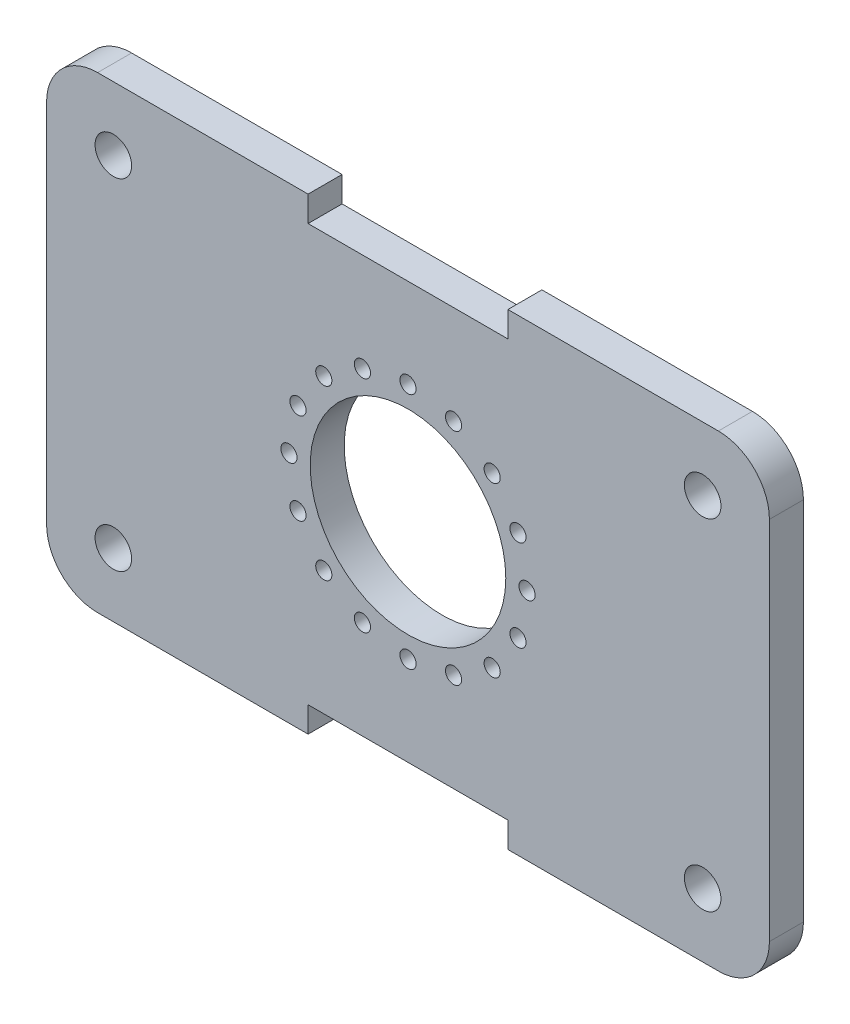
ISO-10303-21;
HEADER;
FILE_DESCRIPTION(('STEP AP214'),'2;1');
FILE_NAME('part.step','',(''),(''),'','','');
FILE_SCHEMA(('AUTOMOTIVE_DESIGN { 1 0 10303 214 1 1 1 1 }'));
ENDSEC;
DATA;
#1=APPLICATION_CONTEXT('core data for automotive mechanical design processes');
#2=APPLICATION_PROTOCOL_DEFINITION('international standard','automotive_design',2000,#1);
#3=PRODUCT_CONTEXT('',#1,'mechanical');
#4=PRODUCT('Part','Part','',(#3));
#5=PRODUCT_RELATED_PRODUCT_CATEGORY('part','',(#4));
#6=PRODUCT_DEFINITION_FORMATION('','',#4);
#7=PRODUCT_DEFINITION_CONTEXT('part definition',#1,'design');
#8=PRODUCT_DEFINITION('design','',#6,#7);
#9=PRODUCT_DEFINITION_SHAPE('','',#8);
#10=(LENGTH_UNIT() NAMED_UNIT(*) SI_UNIT(.MILLI.,.METRE.));
#11=(NAMED_UNIT(*) PLANE_ANGLE_UNIT() SI_UNIT($,.RADIAN.));
#12=(NAMED_UNIT(*) SI_UNIT($,.STERADIAN.) SOLID_ANGLE_UNIT());
#13=UNCERTAINTY_MEASURE_WITH_UNIT(LENGTH_MEASURE(1.E-05),#10,'distance_accuracy_value','');
#14=(GEOMETRIC_REPRESENTATION_CONTEXT(3) GLOBAL_UNCERTAINTY_ASSIGNED_CONTEXT((#13)) GLOBAL_UNIT_ASSIGNED_CONTEXT((#10,
#11,#12)) REPRESENTATION_CONTEXT('',''));
#15=CARTESIAN_POINT('',(0.,0.,0.));
#16=DIRECTION('',(0.,0.,1.));
#17=DIRECTION('',(1.,0.,0.));
#18=AXIS2_PLACEMENT_3D('',#15,#16,#17);
#19=CARTESIAN_POINT('',(-23.5000000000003,-103.999999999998,8.));
#20=DIRECTION('',(1.,0.,0.));
#21=DIRECTION('',(0.,1.,0.));
#22=AXIS2_PLACEMENT_3D('',#19,#20,#21);
#23=PLANE('',#22);
#24=DIRECTION('',(0.,0.,1.));
#25=VECTOR('',#24,1.);
#26=CARTESIAN_POINT('',(-23.5000000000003,-103.999999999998,8.));
#27=LINE('',#26,#25);
#28=CARTESIAN_POINT('',(-23.5000000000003,-103.999999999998,0.));
#29=VERTEX_POINT('',#28);
#30=CARTESIAN_POINT('',(-23.5000000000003,-103.999999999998,8.));
#31=VERTEX_POINT('',#30);
#32=EDGE_CURVE('E11',#29,#31,#27,.T.);
#33=ORIENTED_EDGE('',*,*,#32,.F.);
#34=DIRECTION('',(0.,1.,0.));
#35=VECTOR('',#34,1.);
#36=CARTESIAN_POINT('',(-23.5000000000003,-91.9999999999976,0.));
#37=LINE('',#36,#35);
#38=CARTESIAN_POINT('',(-23.5000000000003,-97.9999999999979,0.));
#39=VERTEX_POINT('',#38);
#40=EDGE_CURVE('E127',#29,#39,#37,.T.);
#41=ORIENTED_EDGE('',*,*,#40,.T.);
#42=DIRECTION('',(0.,0.,1.));
#43=VECTOR('',#42,1.);
#44=CARTESIAN_POINT('',(-23.5000000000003,-97.9999999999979,8.));
#45=LINE('',#44,#43);
#46=CARTESIAN_POINT('',(-23.5000000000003,-97.9999999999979,8.));
#47=VERTEX_POINT('',#46);
#48=EDGE_CURVE('E44',#39,#47,#45,.T.);
#49=ORIENTED_EDGE('',*,*,#48,.T.);
#50=DIRECTION('',(0.,1.,0.));
#51=VECTOR('',#50,1.);
#52=CARTESIAN_POINT('',(-23.5000000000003,-103.999999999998,8.));
#53=LINE('',#52,#51);
#54=EDGE_CURVE('E250',#31,#47,#53,.T.);
#55=ORIENTED_EDGE('',*,*,#54,.F.);
#56=EDGE_LOOP('',(#33,#41,#49,#55));
#57=FACE_BOUND('',#56,.T.);
#58=ADVANCED_FACE('F34',(#57),#23,.T.);
#59=CARTESIAN_POINT('',(-23.5000000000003,-97.9999999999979,8.));
#60=DIRECTION('',(0.,-1.,0.));
#61=DIRECTION('',(1.,0.,0.));
#62=AXIS2_PLACEMENT_3D('',#59,#60,#61);
#63=PLANE('',#62);
#64=ORIENTED_EDGE('',*,*,#48,.F.);
#65=DIRECTION('',(1.,0.,0.));
#66=VECTOR('',#65,1.);
#67=CARTESIAN_POINT('',(-73.0000000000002,-97.9999999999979,0.));
#68=LINE('',#67,#66);
#69=CARTESIAN_POINT('',(23.4999999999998,-97.9999999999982,0.));
#70=VERTEX_POINT('',#69);
#71=EDGE_CURVE('E173',#39,#70,#68,.T.);
#72=ORIENTED_EDGE('',*,*,#71,.T.);
#73=DIRECTION('',(0.,0.,1.));
#74=VECTOR('',#73,1.);
#75=CARTESIAN_POINT('',(23.4999999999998,-97.9999999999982,8.));
#76=LINE('',#75,#74);
#77=CARTESIAN_POINT('',(23.4999999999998,-97.9999999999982,8.));
#78=VERTEX_POINT('',#77);
#79=EDGE_CURVE('E243',#70,#78,#76,.T.);
#80=ORIENTED_EDGE('',*,*,#79,.T.);
#81=DIRECTION('',(1.,0.,0.));
#82=VECTOR('',#81,1.);
#83=CARTESIAN_POINT('',(-23.5000000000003,-97.9999999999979,8.));
#84=LINE('',#83,#82);
#85=EDGE_CURVE('E260',#47,#78,#84,.T.);
#86=ORIENTED_EDGE('',*,*,#85,.F.);
#87=EDGE_LOOP('',(#64,#72,#80,#86));
#88=FACE_BOUND('',#87,.T.);
#89=ADVANCED_FACE('F263',(#88),#63,.T.);
#90=CARTESIAN_POINT('',(23.4999999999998,-97.9999999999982,8.));
#91=DIRECTION('',(-1.,0.,0.));
#92=DIRECTION('',(0.,-1.,0.));
#93=AXIS2_PLACEMENT_3D('',#90,#91,#92);
#94=PLANE('',#93);
#95=ORIENTED_EDGE('',*,*,#79,.F.);
#96=DIRECTION('',(0.,1.,0.));
#97=VECTOR('',#96,1.);
#98=CARTESIAN_POINT('',(23.4999999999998,-91.9999999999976,0.));
#99=LINE('',#98,#97);
#100=CARTESIAN_POINT('',(23.4999999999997,-103.999999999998,0.));
#101=VERTEX_POINT('',#100);
#102=EDGE_CURVE('E170',#70,#101,#99,.F.);
#103=ORIENTED_EDGE('',*,*,#102,.T.);
#104=DIRECTION('',(0.,0.,1.));
#105=VECTOR('',#104,1.);
#106=CARTESIAN_POINT('',(23.4999999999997,-103.999999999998,8.));
#107=LINE('',#106,#105);
#108=CARTESIAN_POINT('',(23.4999999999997,-103.999999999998,8.));
#109=VERTEX_POINT('',#108);
#110=EDGE_CURVE('E240',#101,#109,#107,.T.);
#111=ORIENTED_EDGE('',*,*,#110,.T.);
#112=DIRECTION('',(0.,-1.,0.));
#113=VECTOR('',#112,1.);
#114=CARTESIAN_POINT('',(23.4999999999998,-97.9999999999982,8.));
#115=LINE('',#114,#113);
#116=EDGE_CURVE('E264',#78,#109,#115,.T.);
#117=ORIENTED_EDGE('',*,*,#116,.F.);
#118=EDGE_LOOP('',(#95,#103,#111,#117));
#119=FACE_BOUND('',#118,.T.);
#120=ADVANCED_FACE('F383',(#119),#94,.T.);
#121=CARTESIAN_POINT('',(72.9999999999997,-103.999999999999,8.));
#122=DIRECTION('',(0.,-1.,0.));
#123=DIRECTION('',(1.,0.,0.));
#124=AXIS2_PLACEMENT_3D('',#121,#122,#123);
#125=PLANE('',#124);
#126=ORIENTED_EDGE('',*,*,#110,.F.);
#127=DIRECTION('',(1.,0.,0.));
#128=VECTOR('',#127,1.);
#129=CARTESIAN_POINT('',(-73.0000000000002,-103.999999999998,0.));
#130=LINE('',#129,#128);
#131=CARTESIAN_POINT('',(72.9999999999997,-103.999999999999,0.));
#132=VERTEX_POINT('',#131);
#133=EDGE_CURVE('E167',#101,#132,#130,.T.);
#134=ORIENTED_EDGE('',*,*,#133,.T.);
#135=DIRECTION('',(0.,0.,1.));
#136=VECTOR('',#135,1.);
#137=CARTESIAN_POINT('',(72.9999999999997,-103.999999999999,8.));
#138=LINE('',#137,#136);
#139=CARTESIAN_POINT('',(72.9999999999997,-103.999999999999,8.));
#140=VERTEX_POINT('',#139);
#141=EDGE_CURVE('E237',#132,#140,#138,.T.);
#142=ORIENTED_EDGE('',*,*,#141,.T.);
#143=DIRECTION('',(1.,0.,0.));
#144=VECTOR('',#143,1.);
#145=CARTESIAN_POINT('',(72.9999999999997,-103.999999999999,8.));
#146=LINE('',#145,#144);
#147=EDGE_CURVE('E266',#109,#140,#146,.T.);
#148=ORIENTED_EDGE('',*,*,#147,.F.);
#149=EDGE_LOOP('',(#126,#134,#142,#148));
#150=FACE_BOUND('',#149,.T.);
#151=ADVANCED_FACE('F569',(#150),#125,.T.);
#152=CARTESIAN_POINT('',(72.9999999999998,-91.9999999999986,8.));
#153=DIRECTION('',(0.,0.,1.));
#154=DIRECTION('',(1.,0.,0.));
#155=AXIS2_PLACEMENT_3D('',#152,#153,#154);
#156=CYLINDRICAL_SURFACE('',#155,12.);
#157=ORIENTED_EDGE('',*,*,#141,.F.);
#158=CARTESIAN_POINT('',(72.9999999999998,-91.9999999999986,0.));
#159=DIRECTION('',(0.,0.,1.));
#160=DIRECTION('',(1.,0.,0.));
#161=AXIS2_PLACEMENT_3D('',#158,#159,#160);
#162=CIRCLE('',#161,12.);
#163=CARTESIAN_POINT('',(84.9999999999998,-91.9999999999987,0.));
#164=VERTEX_POINT('',#163);
#165=EDGE_CURVE('E164',#132,#164,#162,.T.);
#166=ORIENTED_EDGE('',*,*,#165,.T.);
#167=DIRECTION('',(0.,0.,1.));
#168=VECTOR('',#167,1.);
#169=CARTESIAN_POINT('',(84.9999999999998,-91.9999999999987,8.));
#170=LINE('',#169,#168);
#171=CARTESIAN_POINT('',(84.9999999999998,-91.9999999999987,8.));
#172=VERTEX_POINT('',#171);
#173=EDGE_CURVE('E234',#164,#172,#170,.T.);
#174=ORIENTED_EDGE('',*,*,#173,.T.);
#175=CARTESIAN_POINT('',(72.9999999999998,-91.9999999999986,8.));
#176=DIRECTION('',(0.,0.,1.));
#177=DIRECTION('',(1.,0.,0.));
#178=AXIS2_PLACEMENT_3D('',#175,#176,#177);
#179=CIRCLE('',#178,12.);
#180=EDGE_CURVE('E272',#140,#172,#179,.T.);
#181=ORIENTED_EDGE('',*,*,#180,.F.);
#182=EDGE_LOOP('',(#157,#166,#174,#181));
#183=FACE_BOUND('',#182,.T.);
#184=ADVANCED_FACE('F566',(#183),#156,.T.);
#185=CARTESIAN_POINT('',(85.,-5.99999999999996,8.));
#186=DIRECTION('',(1.,0.,0.));
#187=DIRECTION('',(0.,1.,0.));
#188=AXIS2_PLACEMENT_3D('',#185,#186,#187);
#189=PLANE('',#188);
#190=ORIENTED_EDGE('',*,*,#173,.F.);
#191=DIRECTION('',(0.,1.,0.));
#192=VECTOR('',#191,1.);
#193=CARTESIAN_POINT('',(84.9999999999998,-91.9999999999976,0.));
#194=LINE('',#193,#192);
#195=CARTESIAN_POINT('',(85.0000000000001,-5.99999999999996,0.));
#196=VERTEX_POINT('',#195);
#197=EDGE_CURVE('E161',#164,#196,#194,.T.);
#198=ORIENTED_EDGE('',*,*,#197,.T.);
#199=DIRECTION('',(0.,0.,1.));
#200=VECTOR('',#199,1.);
#201=CARTESIAN_POINT('',(85.,-5.99999999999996,8.));
#202=LINE('',#201,#200);
#203=CARTESIAN_POINT('',(85.,-5.99999999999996,8.));
#204=VERTEX_POINT('',#203);
#205=EDGE_CURVE('E231',#196,#204,#202,.T.);
#206=ORIENTED_EDGE('',*,*,#205,.T.);
#207=DIRECTION('',(0.,1.,0.));
#208=VECTOR('',#207,1.);
#209=CARTESIAN_POINT('',(85.,-5.99999999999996,8.));
#210=LINE('',#209,#208);
#211=EDGE_CURVE('E275',#172,#204,#210,.T.);
#212=ORIENTED_EDGE('',*,*,#211,.F.);
#213=EDGE_LOOP('',(#190,#198,#206,#212));
#214=FACE_BOUND('',#213,.T.);
#215=ADVANCED_FACE('F561',(#214),#189,.T.);
#216=CARTESIAN_POINT('',(73.,-6.,8.));
#217=DIRECTION('',(0.,0.,1.));
#218=DIRECTION('',(1.,0.,0.));
#219=AXIS2_PLACEMENT_3D('',#216,#217,#218);
#220=CYLINDRICAL_SURFACE('',#219,12.);
#221=ORIENTED_EDGE('',*,*,#205,.F.);
#222=CARTESIAN_POINT('',(73.,-6.,0.));
#223=DIRECTION('',(0.,0.,1.));
#224=DIRECTION('',(1.,0.,0.));
#225=AXIS2_PLACEMENT_3D('',#222,#223,#224);
#226=CIRCLE('',#225,12.);
#227=CARTESIAN_POINT('',(73.0000000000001,6.00000000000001,0.));
#228=VERTEX_POINT('',#227);
#229=EDGE_CURVE('E158',#196,#228,#226,.T.);
#230=ORIENTED_EDGE('',*,*,#229,.T.);
#231=DIRECTION('',(0.,0.,1.));
#232=VECTOR('',#231,1.);
#233=CARTESIAN_POINT('',(73.,6.00000000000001,8.));
#234=LINE('',#233,#232);
#235=CARTESIAN_POINT('',(73.,6.00000000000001,8.));
#236=VERTEX_POINT('',#235);
#237=EDGE_CURVE('E228',#228,#236,#234,.T.);
#238=ORIENTED_EDGE('',*,*,#237,.T.);
#239=CARTESIAN_POINT('',(73.,-6.,8.));
#240=DIRECTION('',(0.,0.,1.));
#241=DIRECTION('',(1.,0.,0.));
#242=AXIS2_PLACEMENT_3D('',#239,#240,#241);
#243=CIRCLE('',#242,12.);
#244=EDGE_CURVE('E278',#204,#236,#243,.T.);
#245=ORIENTED_EDGE('',*,*,#244,.F.);
#246=EDGE_LOOP('',(#221,#230,#238,#245));
#247=FACE_BOUND('',#246,.T.);
#248=ADVANCED_FACE('F557',(#247),#220,.T.);
#249=CARTESIAN_POINT('',(23.5,6.,8.));
#250=DIRECTION('',(0.,1.,0.));
#251=DIRECTION('',(-1.,0.,0.));
#252=AXIS2_PLACEMENT_3D('',#249,#250,#251);
#253=PLANE('',#252);
#254=ORIENTED_EDGE('',*,*,#237,.F.);
#255=DIRECTION('',(1.,0.,0.));
#256=VECTOR('',#255,1.);
#257=CARTESIAN_POINT('',(-73.0000000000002,6.00000000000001,0.));
#258=LINE('',#257,#256);
#259=CARTESIAN_POINT('',(23.5,6.00000000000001,0.));
#260=VERTEX_POINT('',#259);
#261=EDGE_CURVE('E155',#228,#260,#258,.F.);
#262=ORIENTED_EDGE('',*,*,#261,.T.);
#263=DIRECTION('',(0.,0.,1.));
#264=VECTOR('',#263,1.);
#265=CARTESIAN_POINT('',(23.5,6.,8.));
#266=LINE('',#265,#264);
#267=CARTESIAN_POINT('',(23.5,6.,8.));
#268=VERTEX_POINT('',#267);
#269=EDGE_CURVE('E225',#260,#268,#266,.T.);
#270=ORIENTED_EDGE('',*,*,#269,.T.);
#271=DIRECTION('',(-1.,0.,0.));
#272=VECTOR('',#271,1.);
#273=CARTESIAN_POINT('',(23.5,6.,8.));
#274=LINE('',#273,#272);
#275=EDGE_CURVE('E281',#236,#268,#274,.T.);
#276=ORIENTED_EDGE('',*,*,#275,.F.);
#277=EDGE_LOOP('',(#254,#262,#270,#276));
#278=FACE_BOUND('',#277,.T.);
#279=ADVANCED_FACE('F554',(#278),#253,.T.);
#280=CARTESIAN_POINT('',(23.5,0.,8.));
#281=DIRECTION('',(-1.,0.,0.));
#282=DIRECTION('',(0.,-1.,0.));
#283=AXIS2_PLACEMENT_3D('',#280,#281,#282);
#284=PLANE('',#283);
#285=ORIENTED_EDGE('',*,*,#269,.F.);
#286=DIRECTION('',(0.,1.,0.));
#287=VECTOR('',#286,1.);
#288=CARTESIAN_POINT('',(23.5,-91.9999999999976,0.));
#289=LINE('',#288,#287);
#290=CARTESIAN_POINT('',(23.5,0.,0.));
#291=VERTEX_POINT('',#290);
#292=EDGE_CURVE('E152',#260,#291,#289,.F.);
#293=ORIENTED_EDGE('',*,*,#292,.T.);
#294=DIRECTION('',(0.,0.,1.));
#295=VECTOR('',#294,1.);
#296=CARTESIAN_POINT('',(23.5,0.,8.));
#297=LINE('',#296,#295);
#298=CARTESIAN_POINT('',(23.5,0.,8.));
#299=VERTEX_POINT('',#298);
#300=EDGE_CURVE('E222',#291,#299,#297,.T.);
#301=ORIENTED_EDGE('',*,*,#300,.T.);
#302=DIRECTION('',(0.,-1.,0.));
#303=VECTOR('',#302,1.);
#304=CARTESIAN_POINT('',(23.5,0.,8.));
#305=LINE('',#304,#303);
#306=EDGE_CURVE('E284',#268,#299,#305,.T.);
#307=ORIENTED_EDGE('',*,*,#306,.F.);
#308=EDGE_LOOP('',(#285,#293,#301,#307));
#309=FACE_BOUND('',#308,.T.);
#310=ADVANCED_FACE('F549',(#309),#284,.T.);
#311=CARTESIAN_POINT('',(-23.5,0.,8.));
#312=DIRECTION('',(0.,1.,0.));
#313=DIRECTION('',(-1.,0.,0.));
#314=AXIS2_PLACEMENT_3D('',#311,#312,#313);
#315=PLANE('',#314);
#316=ORIENTED_EDGE('',*,*,#300,.F.);
#317=DIRECTION('',(1.,0.,0.));
#318=VECTOR('',#317,1.);
#319=CARTESIAN_POINT('',(-73.0000000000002,0.,0.));
#320=LINE('',#319,#318);
#321=CARTESIAN_POINT('',(-23.5,0.,0.));
#322=VERTEX_POINT('',#321);
#323=EDGE_CURVE('E149',#291,#322,#320,.F.);
#324=ORIENTED_EDGE('',*,*,#323,.T.);
#325=DIRECTION('',(0.,0.,1.));
#326=VECTOR('',#325,1.);
#327=CARTESIAN_POINT('',(-23.5,0.,8.));
#328=LINE('',#327,#326);
#329=CARTESIAN_POINT('',(-23.5,0.,8.));
#330=VERTEX_POINT('',#329);
#331=EDGE_CURVE('E219',#322,#330,#328,.T.);
#332=ORIENTED_EDGE('',*,*,#331,.T.);
#333=DIRECTION('',(-1.,0.,0.));
#334=VECTOR('',#333,1.);
#335=CARTESIAN_POINT('',(-23.5,0.,8.));
#336=LINE('',#335,#334);
#337=EDGE_CURVE('E287',#299,#330,#336,.T.);
#338=ORIENTED_EDGE('',*,*,#337,.F.);
#339=EDGE_LOOP('',(#316,#324,#332,#338));
#340=FACE_BOUND('',#339,.T.);
#341=ADVANCED_FACE('F545',(#340),#315,.T.);
#342=CARTESIAN_POINT('',(-23.5,6.,8.));
#343=DIRECTION('',(1.,0.,0.));
#344=DIRECTION('',(0.,1.,0.));
#345=AXIS2_PLACEMENT_3D('',#342,#343,#344);
#346=PLANE('',#345);
#347=ORIENTED_EDGE('',*,*,#331,.F.);
#348=DIRECTION('',(0.,1.,0.));
#349=VECTOR('',#348,1.);
#350=CARTESIAN_POINT('',(-23.5,-91.9999999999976,0.));
#351=LINE('',#350,#349);
#352=CARTESIAN_POINT('',(-23.5,6.00000000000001,0.));
#353=VERTEX_POINT('',#352);
#354=EDGE_CURVE('E146',#322,#353,#351,.T.);
#355=ORIENTED_EDGE('',*,*,#354,.T.);
#356=DIRECTION('',(0.,0.,1.));
#357=VECTOR('',#356,1.);
#358=CARTESIAN_POINT('',(-23.5,6.,8.));
#359=LINE('',#358,#357);
#360=CARTESIAN_POINT('',(-23.5,6.,8.));
#361=VERTEX_POINT('',#360);
#362=EDGE_CURVE('E216',#353,#361,#359,.T.);
#363=ORIENTED_EDGE('',*,*,#362,.T.);
#364=DIRECTION('',(0.,1.,0.));
#365=VECTOR('',#364,1.);
#366=CARTESIAN_POINT('',(-23.5,6.,8.));
#367=LINE('',#366,#365);
#368=EDGE_CURVE('E290',#330,#361,#367,.T.);
#369=ORIENTED_EDGE('',*,*,#368,.F.);
#370=EDGE_LOOP('',(#347,#355,#363,#369));
#371=FACE_BOUND('',#370,.T.);
#372=ADVANCED_FACE('F542',(#371),#346,.T.);
#373=CARTESIAN_POINT('',(-73.,6.,8.));
#374=DIRECTION('',(0.,1.,0.));
#375=DIRECTION('',(-1.,0.,0.));
#376=AXIS2_PLACEMENT_3D('',#373,#374,#375);
#377=PLANE('',#376);
#378=ORIENTED_EDGE('',*,*,#362,.F.);
#379=DIRECTION('',(1.,0.,0.));
#380=VECTOR('',#379,1.);
#381=CARTESIAN_POINT('',(-73.0000000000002,6.00000000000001,0.));
#382=LINE('',#381,#380);
#383=CARTESIAN_POINT('',(-73.,5.99999999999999,0.));
#384=VERTEX_POINT('',#383);
#385=EDGE_CURVE('E143',#353,#384,#382,.F.);
#386=ORIENTED_EDGE('',*,*,#385,.T.);
#387=DIRECTION('',(0.,0.,1.));
#388=VECTOR('',#387,1.);
#389=CARTESIAN_POINT('',(-73.,5.99999999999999,8.));
#390=LINE('',#389,#388);
#391=CARTESIAN_POINT('',(-73.,5.99999999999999,8.));
#392=VERTEX_POINT('',#391);
#393=EDGE_CURVE('E213',#384,#392,#390,.T.);
#394=ORIENTED_EDGE('',*,*,#393,.T.);
#395=DIRECTION('',(-1.,0.,0.));
#396=VECTOR('',#395,1.);
#397=CARTESIAN_POINT('',(-73.,6.,8.));
#398=LINE('',#397,#396);
#399=EDGE_CURVE('E293',#361,#392,#398,.T.);
#400=ORIENTED_EDGE('',*,*,#399,.F.);
#401=EDGE_LOOP('',(#378,#386,#394,#400));
#402=FACE_BOUND('',#401,.T.);
#403=ADVANCED_FACE('F532',(#402),#377,.T.);
#404=CARTESIAN_POINT('',(-73.,-5.99999999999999,8.));
#405=DIRECTION('',(0.,0.,1.));
#406=DIRECTION('',(1.,0.,0.));
#407=AXIS2_PLACEMENT_3D('',#404,#405,#406);
#408=CYLINDRICAL_SURFACE('',#407,12.);
#409=ORIENTED_EDGE('',*,*,#393,.F.);
#410=CARTESIAN_POINT('',(-73.,-5.99999999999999,0.));
#411=DIRECTION('',(0.,0.,1.));
#412=DIRECTION('',(1.,0.,0.));
#413=AXIS2_PLACEMENT_3D('',#410,#411,#412);
#414=CIRCLE('',#413,12.);
#415=CARTESIAN_POINT('',(-85.,-5.99999999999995,0.));
#416=VERTEX_POINT('',#415);
#417=EDGE_CURVE('E140',#384,#416,#414,.T.);
#418=ORIENTED_EDGE('',*,*,#417,.T.);
#419=DIRECTION('',(0.,0.,1.));
#420=VECTOR('',#419,1.);
#421=CARTESIAN_POINT('',(-85.,-5.99999999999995,8.));
#422=LINE('',#421,#420);
#423=CARTESIAN_POINT('',(-85.,-5.99999999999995,8.));
#424=VERTEX_POINT('',#423);
#425=EDGE_CURVE('E211',#416,#424,#422,.T.);
#426=ORIENTED_EDGE('',*,*,#425,.T.);
#427=CARTESIAN_POINT('',(-73.,-5.99999999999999,8.));
#428=DIRECTION('',(0.,0.,1.));
#429=DIRECTION('',(1.,0.,0.));
#430=AXIS2_PLACEMENT_3D('',#427,#428,#429);
#431=CIRCLE('',#430,12.);
#432=EDGE_CURVE('E296',#392,#424,#431,.T.);
#433=ORIENTED_EDGE('',*,*,#432,.F.);
#434=EDGE_LOOP('',(#409,#418,#426,#433));
#435=FACE_BOUND('',#434,.T.);
#436=ADVANCED_FACE('F538',(#435),#408,.T.);
#437=CARTESIAN_POINT('',(-85.0000000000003,-91.9999999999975,8.));
#438=DIRECTION('',(-1.,0.,0.));
#439=DIRECTION('',(0.,-1.,0.));
#440=AXIS2_PLACEMENT_3D('',#437,#438,#439);
#441=PLANE('',#440);
#442=ORIENTED_EDGE('',*,*,#425,.F.);
#443=DIRECTION('',(0.,1.,0.));
#444=VECTOR('',#443,1.);
#445=CARTESIAN_POINT('',(-85.,-91.9999999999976,0.));
#446=LINE('',#445,#444);
#447=CARTESIAN_POINT('',(-85.0000000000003,-91.9999999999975,0.));
#448=VERTEX_POINT('',#447);
#449=EDGE_CURVE('E137',#416,#448,#446,.F.);
#450=ORIENTED_EDGE('',*,*,#449,.T.);
#451=DIRECTION('',(0.,0.,1.));
#452=VECTOR('',#451,1.);
#453=CARTESIAN_POINT('',(-85.0000000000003,-91.9999999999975,8.));
#454=LINE('',#453,#452);
#455=CARTESIAN_POINT('',(-85.0000000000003,-91.9999999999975,8.));
#456=VERTEX_POINT('',#455);
#457=EDGE_CURVE('E52',#448,#456,#454,.T.);
#458=ORIENTED_EDGE('',*,*,#457,.T.);
#459=DIRECTION('',(0.,-1.,0.));
#460=VECTOR('',#459,1.);
#461=CARTESIAN_POINT('',(-85.0000000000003,-91.9999999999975,8.));
#462=LINE('',#461,#460);
#463=EDGE_CURVE('E299',#424,#456,#462,.T.);
#464=ORIENTED_EDGE('',*,*,#463,.F.);
#465=EDGE_LOOP('',(#442,#450,#458,#464));
#466=FACE_BOUND('',#465,.T.);
#467=ADVANCED_FACE('F459',(#466),#441,.T.);
#468=CARTESIAN_POINT('',(-73.0000000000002,-91.9999999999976,8.));
#469=DIRECTION('',(0.,0.,1.));
#470=DIRECTION('',(1.,0.,0.));
#471=AXIS2_PLACEMENT_3D('',#468,#469,#470);
#472=CYLINDRICAL_SURFACE('',#471,12.);
#473=ORIENTED_EDGE('',*,*,#457,.F.);
#474=CARTESIAN_POINT('',(-73.0000000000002,-91.9999999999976,0.));
#475=DIRECTION('',(0.,0.,1.));
#476=DIRECTION('',(1.,0.,0.));
#477=AXIS2_PLACEMENT_3D('',#474,#475,#476);
#478=CIRCLE('',#477,12.);
#479=CARTESIAN_POINT('',(-73.0000000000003,-103.999999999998,0.));
#480=VERTEX_POINT('',#479);
#481=EDGE_CURVE('E125',#448,#480,#478,.T.);
#482=ORIENTED_EDGE('',*,*,#481,.T.);
#483=DIRECTION('',(0.,0.,1.));
#484=VECTOR('',#483,1.);
#485=CARTESIAN_POINT('',(-73.0000000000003,-103.999999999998,8.));
#486=LINE('',#485,#484);
#487=CARTESIAN_POINT('',(-73.0000000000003,-103.999999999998,8.));
#488=VERTEX_POINT('',#487);
#489=EDGE_CURVE('E38',#480,#488,#486,.T.);
#490=ORIENTED_EDGE('',*,*,#489,.T.);
#491=CARTESIAN_POINT('',(-73.0000000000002,-91.9999999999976,8.));
#492=DIRECTION('',(0.,0.,1.));
#493=DIRECTION('',(1.,0.,0.));
#494=AXIS2_PLACEMENT_3D('',#491,#492,#493);
#495=CIRCLE('',#494,12.);
#496=EDGE_CURVE('E508',#456,#488,#495,.T.);
#497=ORIENTED_EDGE('',*,*,#496,.F.);
#498=EDGE_LOOP('',(#473,#482,#490,#497));
#499=FACE_BOUND('',#498,.T.);
#500=ADVANCED_FACE('F129',(#499),#472,.T.);
#501=CARTESIAN_POINT('',(19.7989898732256,-68.7989898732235,8.));
#502=DIRECTION('',(0.,0.,1.));
#503=DIRECTION('',(1.,0.,0.));
#504=AXIS2_PLACEMENT_3D('',#501,#502,#503);
#505=CYLINDRICAL_SURFACE('',#504,1.89999999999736);
#506=CARTESIAN_POINT('',(19.7989898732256,-68.7989898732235,8.));
#507=DIRECTION('',(0.,0.,1.));
#508=DIRECTION('',(1.,0.,0.));
#509=AXIS2_PLACEMENT_3D('',#506,#507,#508);
#510=CIRCLE('',#509,1.89999999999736);
#511=CARTESIAN_POINT('',(21.6989898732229,-68.7989898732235,8.));
#512=VERTEX_POINT('',#511);
#513=EDGE_CURVE('E209',#512,#512,#510,.T.);
#514=ORIENTED_EDGE('',*,*,#513,.T.);
#515=EDGE_LOOP('',(#514));
#516=FACE_BOUND('',#515,.T.);
#517=CARTESIAN_POINT('',(19.7989898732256,-68.7989898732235,0.));
#518=DIRECTION('',(0.,0.,1.));
#519=DIRECTION('',(1.,0.,0.));
#520=AXIS2_PLACEMENT_3D('',#517,#518,#519);
#521=CIRCLE('',#520,1.89999999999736);
#522=CARTESIAN_POINT('',(21.6989898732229,-68.7989898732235,0.));
#523=VERTEX_POINT('',#522);
#524=EDGE_CURVE('E334',#523,#523,#521,.T.);
#525=ORIENTED_EDGE('',*,*,#524,.F.);
#526=EDGE_LOOP('',(#525));
#527=FACE_BOUND('',#526,.T.);
#528=ADVANCED_FACE('F439',(#516,#527),#505,.F.);
#529=CARTESIAN_POINT('',(28.0000000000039,-48.9999999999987,8.));
#530=DIRECTION('',(0.,0.,1.));
#531=DIRECTION('',(1.,0.,0.));
#532=AXIS2_PLACEMENT_3D('',#529,#530,#531);
#533=CYLINDRICAL_SURFACE('',#532,1.89999999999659);
#534=CARTESIAN_POINT('',(28.0000000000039,-48.9999999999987,8.));
#535=DIRECTION('',(0.,0.,1.));
#536=DIRECTION('',(1.,0.,0.));
#537=AXIS2_PLACEMENT_3D('',#534,#535,#536);
#538=CIRCLE('',#537,1.89999999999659);
#539=CARTESIAN_POINT('',(29.9000000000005,-48.9999999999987,8.));
#540=VERTEX_POINT('',#539);
#541=EDGE_CURVE('E909',#540,#540,#538,.T.);
#542=ORIENTED_EDGE('',*,*,#541,.T.);
#543=EDGE_LOOP('',(#542));
#544=FACE_BOUND('',#543,.T.);
#545=CARTESIAN_POINT('',(28.0000000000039,-48.9999999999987,0.));
#546=DIRECTION('',(0.,0.,1.));
#547=DIRECTION('',(1.,0.,0.));
#548=AXIS2_PLACEMENT_3D('',#545,#546,#547);
#549=CIRCLE('',#548,1.89999999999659);
#550=CARTESIAN_POINT('',(29.9000000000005,-48.9999999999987,0.));
#551=VERTEX_POINT('',#550);
#552=EDGE_CURVE('E337',#551,#551,#549,.T.);
#553=ORIENTED_EDGE('',*,*,#552,.F.);
#554=EDGE_LOOP('',(#553));
#555=FACE_BOUND('',#554,.T.);
#556=ADVANCED_FACE('F450',(#544,#555),#533,.F.);
#557=CARTESIAN_POINT('',(19.7989898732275,-29.2010101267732,8.));
#558=DIRECTION('',(0.,0.,1.));
#559=DIRECTION('',(1.,0.,0.));
#560=AXIS2_PLACEMENT_3D('',#557,#558,#559);
#561=CYLINDRICAL_SURFACE('',#560,1.89999999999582);
#562=CARTESIAN_POINT('',(19.7989898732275,-29.2010101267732,8.));
#563=DIRECTION('',(0.,0.,1.));
#564=DIRECTION('',(1.,0.,0.));
#565=AXIS2_PLACEMENT_3D('',#562,#563,#564);
#566=CIRCLE('',#565,1.89999999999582);
#567=CARTESIAN_POINT('',(21.6989898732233,-29.2010101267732,8.));
#568=VERTEX_POINT('',#567);
#569=EDGE_CURVE('E906',#568,#568,#566,.T.);
#570=ORIENTED_EDGE('',*,*,#569,.T.);
#571=EDGE_LOOP('',(#570));
#572=FACE_BOUND('',#571,.T.);
#573=CARTESIAN_POINT('',(19.7989898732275,-29.2010101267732,0.));
#574=DIRECTION('',(0.,0.,1.));
#575=DIRECTION('',(1.,0.,0.));
#576=AXIS2_PLACEMENT_3D('',#573,#574,#575);
#577=CIRCLE('',#576,1.89999999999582);
#578=CARTESIAN_POINT('',(21.6989898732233,-29.2010101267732,0.));
#579=VERTEX_POINT('',#578);
#580=EDGE_CURVE('E340',#579,#579,#577,.T.);
#581=ORIENTED_EDGE('',*,*,#580,.F.);
#582=EDGE_LOOP('',(#581));
#583=FACE_BOUND('',#582,.T.);
#584=ADVANCED_FACE('F456',(#572,#583),#561,.F.);
#585=CARTESIAN_POINT('',(2.67275090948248E-12,-20.9999999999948,8.));
#586=DIRECTION('',(0.,0.,1.));
#587=DIRECTION('',(1.,0.,0.));
#588=AXIS2_PLACEMENT_3D('',#585,#586,#587);
#589=CYLINDRICAL_SURFACE('',#588,1.89999999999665);
#590=CARTESIAN_POINT('',(2.67275090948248E-12,-20.9999999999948,8.));
#591=DIRECTION('',(0.,0.,1.));
#592=DIRECTION('',(1.,0.,0.));
#593=AXIS2_PLACEMENT_3D('',#590,#591,#592);
#594=CIRCLE('',#593,1.89999999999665);
#595=CARTESIAN_POINT('',(1.89999999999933,-20.9999999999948,8.));
#596=VERTEX_POINT('',#595);
#597=EDGE_CURVE('E903',#596,#596,#594,.T.);
#598=ORIENTED_EDGE('',*,*,#597,.T.);
#599=EDGE_LOOP('',(#598));
#600=FACE_BOUND('',#599,.T.);
#601=CARTESIAN_POINT('',(2.67275090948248E-12,-20.9999999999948,0.));
#602=DIRECTION('',(0.,0.,1.));
#603=DIRECTION('',(1.,0.,0.));
#604=AXIS2_PLACEMENT_3D('',#601,#602,#603);
#605=CIRCLE('',#604,1.89999999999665);
#606=CARTESIAN_POINT('',(1.89999999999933,-20.9999999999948,0.));
#607=VERTEX_POINT('',#606);
#608=EDGE_CURVE('E343',#607,#607,#605,.T.);
#609=ORIENTED_EDGE('',*,*,#608,.F.);
#610=EDGE_LOOP('',(#609));
#611=FACE_BOUND('',#610,.T.);
#612=ADVANCED_FACE('F466',(#600,#611),#589,.F.);
#613=CARTESIAN_POINT('',(-19.7989898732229,-29.2010101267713,8.));
#614=DIRECTION('',(0.,0.,1.));
#615=DIRECTION('',(1.,0.,0.));
#616=AXIS2_PLACEMENT_3D('',#613,#614,#615);
#617=CYLINDRICAL_SURFACE('',#616,1.89999999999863);
#618=CARTESIAN_POINT('',(-19.7989898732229,-29.2010101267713,8.));
#619=DIRECTION('',(0.,0.,1.));
#620=DIRECTION('',(1.,0.,0.));
#621=AXIS2_PLACEMENT_3D('',#618,#619,#620);
#622=CIRCLE('',#621,1.89999999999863);
#623=CARTESIAN_POINT('',(-17.8989898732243,-29.2010101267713,8.));
#624=VERTEX_POINT('',#623);
#625=EDGE_CURVE('E500',#624,#624,#622,.T.);
#626=ORIENTED_EDGE('',*,*,#625,.T.);
#627=EDGE_LOOP('',(#626));
#628=FACE_BOUND('',#627,.T.);
#629=CARTESIAN_POINT('',(-19.7989898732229,-29.2010101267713,0.));
#630=DIRECTION('',(0.,0.,1.));
#631=DIRECTION('',(1.,0.,0.));
#632=AXIS2_PLACEMENT_3D('',#629,#630,#631);
#633=CIRCLE('',#632,1.89999999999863);
#634=CARTESIAN_POINT('',(-17.8989898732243,-29.2010101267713,0.));
#635=VERTEX_POINT('',#634);
#636=EDGE_CURVE('E346',#635,#635,#633,.T.);
#637=ORIENTED_EDGE('',*,*,#636,.F.);
#638=EDGE_LOOP('',(#637));
#639=FACE_BOUND('',#638,.T.);
#640=ADVANCED_FACE('F470',(#628,#639),#617,.F.);
#641=CARTESIAN_POINT('',(-28.0000000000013,-48.9999999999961,8.));
#642=DIRECTION('',(0.,0.,1.));
#643=DIRECTION('',(1.,0.,0.));
#644=AXIS2_PLACEMENT_3D('',#641,#642,#643);
#645=CYLINDRICAL_SURFACE('',#644,1.90000000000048);
#646=CARTESIAN_POINT('',(-28.0000000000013,-48.9999999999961,8.));
#647=DIRECTION('',(0.,0.,1.));
#648=DIRECTION('',(1.,0.,0.));
#649=AXIS2_PLACEMENT_3D('',#646,#647,#648);
#650=CIRCLE('',#649,1.90000000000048);
#651=CARTESIAN_POINT('',(-26.1000000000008,-48.9999999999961,8.));
#652=VERTEX_POINT('',#651);
#653=EDGE_CURVE('E494',#652,#652,#650,.T.);
#654=ORIENTED_EDGE('',*,*,#653,.T.);
#655=EDGE_LOOP('',(#654));
#656=FACE_BOUND('',#655,.T.);
#657=CARTESIAN_POINT('',(-28.0000000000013,-48.9999999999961,0.));
#658=DIRECTION('',(0.,0.,1.));
#659=DIRECTION('',(1.,0.,0.));
#660=AXIS2_PLACEMENT_3D('',#657,#658,#659);
#661=CIRCLE('',#660,1.90000000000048);
#662=CARTESIAN_POINT('',(-26.1000000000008,-48.9999999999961,0.));
#663=VERTEX_POINT('',#662);
#664=EDGE_CURVE('E349',#663,#663,#661,.T.);
#665=ORIENTED_EDGE('',*,*,#664,.F.);
#666=EDGE_LOOP('',(#665));
#667=FACE_BOUND('',#666,.T.);
#668=ADVANCED_FACE('F474',(#656,#667),#645,.F.);
#669=CARTESIAN_POINT('',(-19.7989898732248,-68.7989898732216,8.));
#670=DIRECTION('',(0.,0.,1.));
#671=DIRECTION('',(1.,0.,0.));
#672=AXIS2_PLACEMENT_3D('',#669,#670,#671);
#673=CYLINDRICAL_SURFACE('',#672,1.90000000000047);
#674=CARTESIAN_POINT('',(-19.7989898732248,-68.7989898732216,8.));
#675=DIRECTION('',(0.,0.,1.));
#676=DIRECTION('',(1.,0.,0.));
#677=AXIS2_PLACEMENT_3D('',#674,#675,#676);
#678=CIRCLE('',#677,1.90000000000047);
#679=CARTESIAN_POINT('',(-17.8989898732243,-68.7989898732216,8.));
#680=VERTEX_POINT('',#679);
#681=EDGE_CURVE('E486',#680,#680,#678,.T.);
#682=ORIENTED_EDGE('',*,*,#681,.T.);
#683=EDGE_LOOP('',(#682));
#684=FACE_BOUND('',#683,.T.);
#685=CARTESIAN_POINT('',(-19.7989898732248,-68.7989898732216,0.));
#686=DIRECTION('',(0.,0.,1.));
#687=DIRECTION('',(1.,0.,0.));
#688=AXIS2_PLACEMENT_3D('',#685,#686,#687);
#689=CIRCLE('',#688,1.90000000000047);
#690=CARTESIAN_POINT('',(-17.8989898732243,-68.7989898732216,0.));
#691=VERTEX_POINT('',#690);
#692=EDGE_CURVE('E352',#691,#691,#689,.T.);
#693=ORIENTED_EDGE('',*,*,#692,.F.);
#694=EDGE_LOOP('',(#693));
#695=FACE_BOUND('',#694,.T.);
#696=ADVANCED_FACE('F374',(#684,#695),#673,.F.);
#697=CARTESIAN_POINT('',(-69.3,-89.,8.));
#698=DIRECTION('',(0.,0.,1.));
#699=DIRECTION('',(1.,0.,0.));
#700=AXIS2_PLACEMENT_3D('',#697,#698,#699);
#701=CYLINDRICAL_SURFACE('',#700,4.3);
#702=CARTESIAN_POINT('',(-69.3,-89.,8.));
#703=DIRECTION('',(0.,0.,1.));
#704=DIRECTION('',(1.,0.,0.));
#705=AXIS2_PLACEMENT_3D('',#702,#703,#704);
#706=CIRCLE('',#705,4.3);
#707=CARTESIAN_POINT('',(-65.,-89.,8.));
#708=VERTEX_POINT('',#707);
#709=EDGE_CURVE('E493',#708,#708,#706,.T.);
#710=ORIENTED_EDGE('',*,*,#709,.T.);
#711=EDGE_LOOP('',(#710));
#712=FACE_BOUND('',#711,.T.);
#713=CARTESIAN_POINT('',(-69.3,-89.,0.));
#714=DIRECTION('',(0.,0.,1.));
#715=DIRECTION('',(1.,0.,0.));
#716=AXIS2_PLACEMENT_3D('',#713,#714,#715);
#717=CIRCLE('',#716,4.3);
#718=CARTESIAN_POINT('',(-65.,-89.,0.));
#719=VERTEX_POINT('',#718);
#720=EDGE_CURVE('E355',#719,#719,#717,.T.);
#721=ORIENTED_EDGE('',*,*,#720,.F.);
#722=EDGE_LOOP('',(#721));
#723=FACE_BOUND('',#722,.T.);
#724=ADVANCED_FACE('F365',(#712,#723),#701,.F.);
#725=CARTESIAN_POINT('',(69.3,-9.00000000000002,8.));
#726=DIRECTION('',(0.,0.,1.));
#727=DIRECTION('',(1.,0.,0.));
#728=AXIS2_PLACEMENT_3D('',#725,#726,#727);
#729=CYLINDRICAL_SURFACE('',#728,4.3);
#730=CARTESIAN_POINT('',(69.3,-9.00000000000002,8.));
#731=DIRECTION('',(0.,0.,1.));
#732=DIRECTION('',(1.,0.,0.));
#733=AXIS2_PLACEMENT_3D('',#730,#731,#732);
#734=CIRCLE('',#733,4.3);
#735=CARTESIAN_POINT('',(73.6,-9.00000000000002,8.));
#736=VERTEX_POINT('',#735);
#737=EDGE_CURVE('E497',#736,#736,#734,.T.);
#738=ORIENTED_EDGE('',*,*,#737,.T.);
#739=EDGE_LOOP('',(#738));
#740=FACE_BOUND('',#739,.T.);
#741=CARTESIAN_POINT('',(69.3,-9.00000000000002,0.));
#742=DIRECTION('',(0.,0.,1.));
#743=DIRECTION('',(1.,0.,0.));
#744=AXIS2_PLACEMENT_3D('',#741,#742,#743);
#745=CIRCLE('',#744,4.3);
#746=CARTESIAN_POINT('',(73.6,-9.00000000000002,0.));
#747=VERTEX_POINT('',#746);
#748=EDGE_CURVE('E133',#747,#747,#745,.T.);
#749=ORIENTED_EDGE('',*,*,#748,.F.);
#750=EDGE_LOOP('',(#749));
#751=FACE_BOUND('',#750,.T.);
#752=ADVANCED_FACE('F362',(#740,#751),#729,.F.);
#753=CARTESIAN_POINT('',(-3.05311331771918E-13,-77.,8.));
#754=DIRECTION('',(0.,0.,1.));
#755=DIRECTION('',(1.,0.,0.));
#756=AXIS2_PLACEMENT_3D('',#753,#754,#755);
#757=CYLINDRICAL_SURFACE('',#756,1.9);
#758=CARTESIAN_POINT('',(-3.05311331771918E-13,-77.,8.));
#759=DIRECTION('',(0.,0.,1.));
#760=DIRECTION('',(1.,0.,0.));
#761=AXIS2_PLACEMENT_3D('',#758,#759,#760);
#762=CIRCLE('',#761,1.9);
#763=CARTESIAN_POINT('',(1.89999999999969,-77.,8.));
#764=VERTEX_POINT('',#763);
#765=EDGE_CURVE('E505',#764,#764,#762,.T.);
#766=ORIENTED_EDGE('',*,*,#765,.T.);
#767=EDGE_LOOP('',(#766));
#768=FACE_BOUND('',#767,.T.);
#769=CARTESIAN_POINT('',(-3.05311331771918E-13,-77.,0.));
#770=DIRECTION('',(0.,0.,1.));
#771=DIRECTION('',(1.,0.,0.));
#772=AXIS2_PLACEMENT_3D('',#769,#770,#771);
#773=CIRCLE('',#772,1.9);
#774=CARTESIAN_POINT('',(1.89999999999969,-77.,0.));
#775=VERTEX_POINT('',#774);
#776=EDGE_CURVE('E130',#775,#775,#773,.T.);
#777=ORIENTED_EDGE('',*,*,#776,.F.);
#778=EDGE_LOOP('',(#777));
#779=FACE_BOUND('',#778,.T.);
#780=ADVANCED_FACE('F364',(#768,#779),#757,.F.);
#781=CARTESIAN_POINT('',(-23.5000000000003,-103.999999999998,8.));
#782=DIRECTION('',(0.,-1.,0.));
#783=DIRECTION('',(1.,0.,0.));
#784=AXIS2_PLACEMENT_3D('',#781,#782,#783);
#785=PLANE('',#784);
#786=DIRECTION('',(1.,0.,0.));
#787=VECTOR('',#786,1.);
#788=CARTESIAN_POINT('',(-73.0000000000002,-103.999999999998,0.));
#789=LINE('',#788,#787);
#790=EDGE_CURVE('E113',#480,#29,#789,.T.);
#791=ORIENTED_EDGE('',*,*,#790,.T.);
#792=ORIENTED_EDGE('',*,*,#32,.T.);
#793=DIRECTION('',(1.,0.,0.));
#794=VECTOR('',#793,1.);
#795=CARTESIAN_POINT('',(-23.5000000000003,-103.999999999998,8.));
#796=LINE('',#795,#794);
#797=EDGE_CURVE('E115',#488,#31,#796,.T.);
#798=ORIENTED_EDGE('',*,*,#797,.F.);
#799=ORIENTED_EDGE('',*,*,#489,.F.);
#800=EDGE_LOOP('',(#791,#792,#798,#799));
#801=FACE_BOUND('',#800,.T.);
#802=ADVANCED_FACE('F112',(#801),#785,.T.);
#803=CARTESIAN_POINT('',(0.,-49.,8.));
#804=DIRECTION('',(0.,0.,1.));
#805=DIRECTION('',(1.,0.,0.));
#806=AXIS2_PLACEMENT_3D('',#803,#804,#805);
#807=CYLINDRICAL_SURFACE('',#806,23.);
#808=CARTESIAN_POINT('',(0.,-49.,8.));
#809=DIRECTION('',(0.,0.,1.));
#810=DIRECTION('',(1.,0.,0.));
#811=AXIS2_PLACEMENT_3D('',#808,#809,#810);
#812=CIRCLE('',#811,23.);
#813=CARTESIAN_POINT('',(23.,-49.,8.));
#814=VERTEX_POINT('',#813);
#815=EDGE_CURVE('E302',#814,#814,#812,.T.);
#816=ORIENTED_EDGE('',*,*,#815,.T.);
#817=EDGE_LOOP('',(#816));
#818=FACE_BOUND('',#817,.T.);
#819=CARTESIAN_POINT('',(0.,-49.,0.));
#820=DIRECTION('',(0.,0.,1.));
#821=DIRECTION('',(1.,0.,0.));
#822=AXIS2_PLACEMENT_3D('',#819,#820,#821);
#823=CIRCLE('',#822,23.);
#824=CARTESIAN_POINT('',(23.,-49.,0.));
#825=VERTEX_POINT('',#824);
#826=EDGE_CURVE('E139',#825,#825,#823,.T.);
#827=ORIENTED_EDGE('',*,*,#826,.F.);
#828=EDGE_LOOP('',(#827));
#829=FACE_BOUND('',#828,.T.);
#830=ADVANCED_FACE('F389',(#818,#829),#807,.F.);
#831=CARTESIAN_POINT('',(-69.3,-9.00000000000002,8.));
#832=DIRECTION('',(0.,0.,1.));
#833=DIRECTION('',(1.,0.,0.));
#834=AXIS2_PLACEMENT_3D('',#831,#832,#833);
#835=CYLINDRICAL_SURFACE('',#834,4.3);
#836=CARTESIAN_POINT('',(-69.3,-9.00000000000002,8.));
#837=DIRECTION('',(0.,0.,1.));
#838=DIRECTION('',(1.,0.,0.));
#839=AXIS2_PLACEMENT_3D('',#836,#837,#838);
#840=CIRCLE('',#839,4.3);
#841=CARTESIAN_POINT('',(-65.,-9.00000000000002,8.));
#842=VERTEX_POINT('',#841);
#843=EDGE_CURVE('E305',#842,#842,#840,.T.);
#844=ORIENTED_EDGE('',*,*,#843,.T.);
#845=EDGE_LOOP('',(#844));
#846=FACE_BOUND('',#845,.T.);
#847=CARTESIAN_POINT('',(-69.3,-9.00000000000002,0.));
#848=DIRECTION('',(0.,0.,1.));
#849=DIRECTION('',(1.,0.,0.));
#850=AXIS2_PLACEMENT_3D('',#847,#848,#849);
#851=CIRCLE('',#850,4.3);
#852=CARTESIAN_POINT('',(-65.,-9.00000000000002,0.));
#853=VERTEX_POINT('',#852);
#854=EDGE_CURVE('E179',#853,#853,#851,.T.);
#855=ORIENTED_EDGE('',*,*,#854,.F.);
#856=EDGE_LOOP('',(#855));
#857=FACE_BOUND('',#856,.T.);
#858=ADVANCED_FACE('F392',(#846,#857),#835,.F.);
#859=CARTESIAN_POINT('',(69.3,-89.,8.));
#860=DIRECTION('',(0.,0.,1.));
#861=DIRECTION('',(1.,0.,0.));
#862=AXIS2_PLACEMENT_3D('',#859,#860,#861);
#863=CYLINDRICAL_SURFACE('',#862,4.3);
#864=CARTESIAN_POINT('',(69.3,-89.,8.));
#865=DIRECTION('',(0.,0.,1.));
#866=DIRECTION('',(1.,0.,0.));
#867=AXIS2_PLACEMENT_3D('',#864,#865,#866);
#868=CIRCLE('',#867,4.3);
#869=CARTESIAN_POINT('',(73.6,-89.,8.));
#870=VERTEX_POINT('',#869);
#871=EDGE_CURVE('E308',#870,#870,#868,.T.);
#872=ORIENTED_EDGE('',*,*,#871,.T.);
#873=EDGE_LOOP('',(#872));
#874=FACE_BOUND('',#873,.T.);
#875=CARTESIAN_POINT('',(69.3,-89.,0.));
#876=DIRECTION('',(0.,0.,1.));
#877=DIRECTION('',(1.,0.,0.));
#878=AXIS2_PLACEMENT_3D('',#875,#876,#877);
#879=CIRCLE('',#878,4.3);
#880=CARTESIAN_POINT('',(73.6,-89.,0.));
#881=VERTEX_POINT('',#880);
#882=EDGE_CURVE('E182',#881,#881,#879,.T.);
#883=ORIENTED_EDGE('',*,*,#882,.F.);
#884=EDGE_LOOP('',(#883));
#885=FACE_BOUND('',#884,.T.);
#886=ADVANCED_FACE('F396',(#874,#885),#863,.F.);
#887=CARTESIAN_POINT('',(-10.7151361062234,-74.8686269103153,8.));
#888=DIRECTION('',(0.,0.,1.));
#889=DIRECTION('',(1.,0.,0.));
#890=AXIS2_PLACEMENT_3D('',#887,#888,#889);
#891=CYLINDRICAL_SURFACE('',#890,1.90000000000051);
#892=CARTESIAN_POINT('',(-10.7151361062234,-74.8686269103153,8.));
#893=DIRECTION('',(0.,0.,1.));
#894=DIRECTION('',(1.,0.,0.));
#895=AXIS2_PLACEMENT_3D('',#892,#893,#894);
#896=CIRCLE('',#895,1.90000000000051);
#897=CARTESIAN_POINT('',(-8.8151361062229,-74.8686269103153,8.));
#898=VERTEX_POINT('',#897);
#899=EDGE_CURVE('E311',#898,#898,#896,.T.);
#900=ORIENTED_EDGE('',*,*,#899,.T.);
#901=EDGE_LOOP('',(#900));
#902=FACE_BOUND('',#901,.T.);
#903=CARTESIAN_POINT('',(-10.7151361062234,-74.8686269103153,0.));
#904=DIRECTION('',(0.,0.,1.));
#905=DIRECTION('',(1.,0.,0.));
#906=AXIS2_PLACEMENT_3D('',#903,#904,#905);
#907=CIRCLE('',#906,1.90000000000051);
#908=CARTESIAN_POINT('',(-8.8151361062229,-74.8686269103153,0.));
#909=VERTEX_POINT('',#908);
#910=EDGE_CURVE('E185',#909,#909,#907,.T.);
#911=ORIENTED_EDGE('',*,*,#910,.F.);
#912=EDGE_LOOP('',(#911));
#913=FACE_BOUND('',#912,.T.);
#914=ADVANCED_FACE('F400',(#902,#913),#891,.F.);
#915=CARTESIAN_POINT('',(-25.8686269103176,-59.7151361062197,8.));
#916=DIRECTION('',(0.,0.,1.));
#917=DIRECTION('',(1.,0.,0.));
#918=AXIS2_PLACEMENT_3D('',#915,#916,#917);
#919=CYLINDRICAL_SURFACE('',#918,1.90000000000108);
#920=CARTESIAN_POINT('',(-25.8686269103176,-59.7151361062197,8.));
#921=DIRECTION('',(0.,0.,1.));
#922=DIRECTION('',(1.,0.,0.));
#923=AXIS2_PLACEMENT_3D('',#920,#921,#922);
#924=CIRCLE('',#923,1.90000000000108);
#925=CARTESIAN_POINT('',(-23.9686269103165,-59.7151361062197,8.));
#926=VERTEX_POINT('',#925);
#927=EDGE_CURVE('E314',#926,#926,#924,.T.);
#928=ORIENTED_EDGE('',*,*,#927,.T.);
#929=EDGE_LOOP('',(#928));
#930=FACE_BOUND('',#929,.T.);
#931=CARTESIAN_POINT('',(-25.8686269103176,-59.7151361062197,0.));
#932=DIRECTION('',(0.,0.,1.));
#933=DIRECTION('',(1.,0.,0.));
#934=AXIS2_PLACEMENT_3D('',#931,#932,#933);
#935=CIRCLE('',#934,1.90000000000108);
#936=CARTESIAN_POINT('',(-23.9686269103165,-59.7151361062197,0.));
#937=VERTEX_POINT('',#936);
#938=EDGE_CURVE('E188',#937,#937,#935,.T.);
#939=ORIENTED_EDGE('',*,*,#938,.F.);
#940=EDGE_LOOP('',(#939));
#941=FACE_BOUND('',#940,.T.);
#942=ADVANCED_FACE('F404',(#930,#941),#919,.F.);
#943=CARTESIAN_POINT('',(-25.8686269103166,-38.2848638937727,8.));
#944=DIRECTION('',(0.,0.,1.));
#945=DIRECTION('',(1.,0.,0.));
#946=AXIS2_PLACEMENT_3D('',#943,#944,#945);
#947=CYLINDRICAL_SURFACE('',#946,1.89999999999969);
#948=CARTESIAN_POINT('',(-25.8686269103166,-38.2848638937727,8.));
#949=DIRECTION('',(0.,0.,1.));
#950=DIRECTION('',(1.,0.,0.));
#951=AXIS2_PLACEMENT_3D('',#948,#949,#950);
#952=CIRCLE('',#951,1.89999999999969);
#953=CARTESIAN_POINT('',(-23.9686269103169,-38.2848638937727,8.));
#954=VERTEX_POINT('',#953);
#955=EDGE_CURVE('E317',#954,#954,#952,.T.);
#956=ORIENTED_EDGE('',*,*,#955,.T.);
#957=EDGE_LOOP('',(#956));
#958=FACE_BOUND('',#957,.T.);
#959=CARTESIAN_POINT('',(-25.8686269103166,-38.2848638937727,0.));
#960=DIRECTION('',(0.,0.,1.));
#961=DIRECTION('',(1.,0.,0.));
#962=AXIS2_PLACEMENT_3D('',#959,#960,#961);
#963=CIRCLE('',#962,1.89999999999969);
#964=CARTESIAN_POINT('',(-23.9686269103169,-38.2848638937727,0.));
#965=VERTEX_POINT('',#964);
#966=EDGE_CURVE('E191',#965,#965,#963,.T.);
#967=ORIENTED_EDGE('',*,*,#966,.F.);
#968=EDGE_LOOP('',(#967));
#969=FACE_BOUND('',#968,.T.);
#970=ADVANCED_FACE('F408',(#958,#969),#947,.F.);
#971=CARTESIAN_POINT('',(-10.7151361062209,-23.1313730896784,8.));
#972=DIRECTION('',(0.,0.,1.));
#973=DIRECTION('',(1.,0.,0.));
#974=AXIS2_PLACEMENT_3D('',#971,#972,#973);
#975=CYLINDRICAL_SURFACE('',#974,1.89999999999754);
#976=CARTESIAN_POINT('',(-10.7151361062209,-23.1313730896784,8.));
#977=DIRECTION('',(0.,0.,1.));
#978=DIRECTION('',(1.,0.,0.));
#979=AXIS2_PLACEMENT_3D('',#976,#977,#978);
#980=CIRCLE('',#979,1.89999999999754);
#981=CARTESIAN_POINT('',(-8.81513610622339,-23.1313730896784,8.));
#982=VERTEX_POINT('',#981);
#983=EDGE_CURVE('E320',#982,#982,#980,.T.);
#984=ORIENTED_EDGE('',*,*,#983,.T.);
#985=EDGE_LOOP('',(#984));
#986=FACE_BOUND('',#985,.T.);
#987=CARTESIAN_POINT('',(-10.7151361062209,-23.1313730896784,0.));
#988=DIRECTION('',(0.,0.,1.));
#989=DIRECTION('',(1.,0.,0.));
#990=AXIS2_PLACEMENT_3D('',#987,#988,#989);
#991=CIRCLE('',#990,1.89999999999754);
#992=CARTESIAN_POINT('',(-8.81513610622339,-23.1313730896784,0.));
#993=VERTEX_POINT('',#992);
#994=EDGE_CURVE('E194',#993,#993,#991,.T.);
#995=ORIENTED_EDGE('',*,*,#994,.F.);
#996=EDGE_LOOP('',(#995));
#997=FACE_BOUND('',#996,.T.);
#998=ADVANCED_FACE('F412',(#986,#997),#975,.F.);
#999=CARTESIAN_POINT('',(10.7151361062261,-23.1313730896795,8.));
#1000=DIRECTION('',(0.,0.,1.));
#1001=DIRECTION('',(1.,0.,0.));
#1002=AXIS2_PLACEMENT_3D('',#999,#1000,#1001);
#1003=CYLINDRICAL_SURFACE('',#1002,1.89999999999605);
#1004=CARTESIAN_POINT('',(10.7151361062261,-23.1313730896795,8.));
#1005=DIRECTION('',(0.,0.,1.));
#1006=DIRECTION('',(1.,0.,0.));
#1007=AXIS2_PLACEMENT_3D('',#1004,#1005,#1006);
#1008=CIRCLE('',#1007,1.89999999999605);
#1009=CARTESIAN_POINT('',(12.6151361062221,-23.1313730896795,8.));
#1010=VERTEX_POINT('',#1009);
#1011=EDGE_CURVE('E323',#1010,#1010,#1008,.T.);
#1012=ORIENTED_EDGE('',*,*,#1011,.T.);
#1013=EDGE_LOOP('',(#1012));
#1014=FACE_BOUND('',#1013,.T.);
#1015=CARTESIAN_POINT('',(10.7151361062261,-23.1313730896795,0.));
#1016=DIRECTION('',(0.,0.,1.));
#1017=DIRECTION('',(1.,0.,0.));
#1018=AXIS2_PLACEMENT_3D('',#1015,#1016,#1017);
#1019=CIRCLE('',#1018,1.89999999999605);
#1020=CARTESIAN_POINT('',(12.6151361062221,-23.1313730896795,0.));
#1021=VERTEX_POINT('',#1020);
#1022=EDGE_CURVE('E197',#1021,#1021,#1019,.T.);
#1023=ORIENTED_EDGE('',*,*,#1022,.F.);
#1024=EDGE_LOOP('',(#1023));
#1025=FACE_BOUND('',#1024,.T.);
#1026=ADVANCED_FACE('F416',(#1014,#1025),#1003,.F.);
#1027=CARTESIAN_POINT('',(25.8686269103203,-38.2848638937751,8.));
#1028=DIRECTION('',(0.,0.,1.));
#1029=DIRECTION('',(1.,0.,0.));
#1030=AXIS2_PLACEMENT_3D('',#1027,#1028,#1029);
#1031=CYLINDRICAL_SURFACE('',#1030,1.89999999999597);
#1032=CARTESIAN_POINT('',(25.8686269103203,-38.2848638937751,8.));
#1033=DIRECTION('',(0.,0.,1.));
#1034=DIRECTION('',(1.,0.,0.));
#1035=AXIS2_PLACEMENT_3D('',#1032,#1033,#1034);
#1036=CIRCLE('',#1035,1.89999999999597);
#1037=CARTESIAN_POINT('',(27.7686269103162,-38.2848638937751,8.));
#1038=VERTEX_POINT('',#1037);
#1039=EDGE_CURVE('E326',#1038,#1038,#1036,.T.);
#1040=ORIENTED_EDGE('',*,*,#1039,.T.);
#1041=EDGE_LOOP('',(#1040));
#1042=FACE_BOUND('',#1041,.T.);
#1043=CARTESIAN_POINT('',(25.8686269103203,-38.2848638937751,0.));
#1044=DIRECTION('',(0.,0.,1.));
#1045=DIRECTION('',(1.,0.,0.));
#1046=AXIS2_PLACEMENT_3D('',#1043,#1044,#1045);
#1047=CIRCLE('',#1046,1.89999999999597);
#1048=CARTESIAN_POINT('',(27.7686269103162,-38.2848638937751,0.));
#1049=VERTEX_POINT('',#1048);
#1050=EDGE_CURVE('E200',#1049,#1049,#1047,.T.);
#1051=ORIENTED_EDGE('',*,*,#1050,.F.);
#1052=EDGE_LOOP('',(#1051));
#1053=FACE_BOUND('',#1052,.T.);
#1054=ADVANCED_FACE('F420',(#1042,#1053),#1031,.F.);
#1055=CARTESIAN_POINT('',(25.8686269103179,-59.7151361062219,8.));
#1056=DIRECTION('',(0.,0.,1.));
#1057=DIRECTION('',(1.,0.,0.));
#1058=AXIS2_PLACEMENT_3D('',#1055,#1056,#1057);
#1059=CYLINDRICAL_SURFACE('',#1058,1.89999999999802);
#1060=CARTESIAN_POINT('',(25.8686269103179,-59.7151361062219,8.));
#1061=DIRECTION('',(0.,0.,1.));
#1062=DIRECTION('',(1.,0.,0.));
#1063=AXIS2_PLACEMENT_3D('',#1060,#1061,#1062);
#1064=CIRCLE('',#1063,1.89999999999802);
#1065=CARTESIAN_POINT('',(27.7686269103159,-59.7151361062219,8.));
#1066=VERTEX_POINT('',#1065);
#1067=EDGE_CURVE('E329',#1066,#1066,#1064,.T.);
#1068=ORIENTED_EDGE('',*,*,#1067,.T.);
#1069=EDGE_LOOP('',(#1068));
#1070=FACE_BOUND('',#1069,.T.);
#1071=CARTESIAN_POINT('',(25.8686269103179,-59.7151361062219,0.));
#1072=DIRECTION('',(0.,0.,1.));
#1073=DIRECTION('',(1.,0.,0.));
#1074=AXIS2_PLACEMENT_3D('',#1071,#1072,#1073);
#1075=CIRCLE('',#1074,1.89999999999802);
#1076=CARTESIAN_POINT('',(27.7686269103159,-59.7151361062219,0.));
#1077=VERTEX_POINT('',#1076);
#1078=EDGE_CURVE('E203',#1077,#1077,#1075,.T.);
#1079=ORIENTED_EDGE('',*,*,#1078,.F.);
#1080=EDGE_LOOP('',(#1079));
#1081=FACE_BOUND('',#1080,.T.);
#1082=ADVANCED_FACE('F423',(#1070,#1081),#1059,.F.);
#1083=CARTESIAN_POINT('',(10.7151361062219,-74.8686269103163,8.));
#1084=DIRECTION('',(0.,0.,1.));
#1085=DIRECTION('',(1.,0.,0.));
#1086=AXIS2_PLACEMENT_3D('',#1083,#1084,#1085);
#1087=CYLINDRICAL_SURFACE('',#1086,1.9);
#1088=CARTESIAN_POINT('',(10.7151361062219,-74.8686269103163,8.));
#1089=DIRECTION('',(0.,0.,1.));
#1090=DIRECTION('',(1.,0.,0.));
#1091=AXIS2_PLACEMENT_3D('',#1088,#1089,#1090);
#1092=CIRCLE('',#1091,1.9);
#1093=CARTESIAN_POINT('',(12.6151361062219,-74.8686269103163,8.));
#1094=VERTEX_POINT('',#1093);
#1095=EDGE_CURVE('E119',#1094,#1094,#1092,.T.);
#1096=ORIENTED_EDGE('',*,*,#1095,.T.);
#1097=EDGE_LOOP('',(#1096));
#1098=FACE_BOUND('',#1097,.T.);
#1099=CARTESIAN_POINT('',(10.7151361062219,-74.8686269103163,0.));
#1100=DIRECTION('',(0.,0.,1.));
#1101=DIRECTION('',(1.,0.,0.));
#1102=AXIS2_PLACEMENT_3D('',#1099,#1100,#1101);
#1103=CIRCLE('',#1102,1.9);
#1104=CARTESIAN_POINT('',(12.6151361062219,-74.8686269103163,0.));
#1105=VERTEX_POINT('',#1104);
#1106=EDGE_CURVE('E206',#1105,#1105,#1103,.T.);
#1107=ORIENTED_EDGE('',*,*,#1106,.F.);
#1108=EDGE_LOOP('',(#1107));
#1109=FACE_BOUND('',#1108,.T.);
#1110=ADVANCED_FACE('F36',(#1098,#1109),#1087,.F.);
#1111=CARTESIAN_POINT('',(-73.0000000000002,-91.9999999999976,8.));
#1112=DIRECTION('',(0.,0.,1.));
#1113=DIRECTION('',(1.,0.,0.));
#1114=AXIS2_PLACEMENT_3D('',#1111,#1112,#1113);
#1115=PLANE('',#1114);
#1116=ORIENTED_EDGE('',*,*,#513,.F.);
#1117=EDGE_LOOP('',(#1116));
#1118=FACE_BOUND('',#1117,.T.);
#1119=ORIENTED_EDGE('',*,*,#541,.F.);
#1120=EDGE_LOOP('',(#1119));
#1121=FACE_BOUND('',#1120,.T.);
#1122=ORIENTED_EDGE('',*,*,#569,.F.);
#1123=EDGE_LOOP('',(#1122));
#1124=FACE_BOUND('',#1123,.T.);
#1125=ORIENTED_EDGE('',*,*,#597,.F.);
#1126=EDGE_LOOP('',(#1125));
#1127=FACE_BOUND('',#1126,.T.);
#1128=ORIENTED_EDGE('',*,*,#625,.F.);
#1129=EDGE_LOOP('',(#1128));
#1130=FACE_BOUND('',#1129,.T.);
#1131=ORIENTED_EDGE('',*,*,#653,.F.);
#1132=EDGE_LOOP('',(#1131));
#1133=FACE_BOUND('',#1132,.T.);
#1134=ORIENTED_EDGE('',*,*,#681,.F.);
#1135=EDGE_LOOP('',(#1134));
#1136=FACE_BOUND('',#1135,.T.);
#1137=ORIENTED_EDGE('',*,*,#709,.F.);
#1138=EDGE_LOOP('',(#1137));
#1139=FACE_BOUND('',#1138,.T.);
#1140=ORIENTED_EDGE('',*,*,#737,.F.);
#1141=EDGE_LOOP('',(#1140));
#1142=FACE_BOUND('',#1141,.T.);
#1143=ORIENTED_EDGE('',*,*,#765,.F.);
#1144=EDGE_LOOP('',(#1143));
#1145=FACE_BOUND('',#1144,.T.);
#1146=ORIENTED_EDGE('',*,*,#496,.T.);
#1147=ORIENTED_EDGE('',*,*,#797,.T.);
#1148=ORIENTED_EDGE('',*,*,#54,.T.);
#1149=ORIENTED_EDGE('',*,*,#85,.T.);
#1150=ORIENTED_EDGE('',*,*,#116,.T.);
#1151=ORIENTED_EDGE('',*,*,#147,.T.);
#1152=ORIENTED_EDGE('',*,*,#180,.T.);
#1153=ORIENTED_EDGE('',*,*,#211,.T.);
#1154=ORIENTED_EDGE('',*,*,#244,.T.);
#1155=ORIENTED_EDGE('',*,*,#275,.T.);
#1156=ORIENTED_EDGE('',*,*,#306,.T.);
#1157=ORIENTED_EDGE('',*,*,#337,.T.);
#1158=ORIENTED_EDGE('',*,*,#368,.T.);
#1159=ORIENTED_EDGE('',*,*,#399,.T.);
#1160=ORIENTED_EDGE('',*,*,#432,.T.);
#1161=ORIENTED_EDGE('',*,*,#463,.T.);
#1162=EDGE_LOOP('',(#1146,#1147,#1148,#1149,#1150,#1151,#1152,#1153,#1154,#1155,#1156,#1157,
#1158,#1159,#1160,#1161));
#1163=FACE_BOUND('',#1162,.T.);
#1164=ORIENTED_EDGE('',*,*,#815,.F.);
#1165=EDGE_LOOP('',(#1164));
#1166=FACE_BOUND('',#1165,.T.);
#1167=ORIENTED_EDGE('',*,*,#843,.F.);
#1168=EDGE_LOOP('',(#1167));
#1169=FACE_BOUND('',#1168,.T.);
#1170=ORIENTED_EDGE('',*,*,#871,.F.);
#1171=EDGE_LOOP('',(#1170));
#1172=FACE_BOUND('',#1171,.T.);
#1173=ORIENTED_EDGE('',*,*,#899,.F.);
#1174=EDGE_LOOP('',(#1173));
#1175=FACE_BOUND('',#1174,.T.);
#1176=ORIENTED_EDGE('',*,*,#927,.F.);
#1177=EDGE_LOOP('',(#1176));
#1178=FACE_BOUND('',#1177,.T.);
#1179=ORIENTED_EDGE('',*,*,#955,.F.);
#1180=EDGE_LOOP('',(#1179));
#1181=FACE_BOUND('',#1180,.T.);
#1182=ORIENTED_EDGE('',*,*,#983,.F.);
#1183=EDGE_LOOP('',(#1182));
#1184=FACE_BOUND('',#1183,.T.);
#1185=ORIENTED_EDGE('',*,*,#1011,.F.);
#1186=EDGE_LOOP('',(#1185));
#1187=FACE_BOUND('',#1186,.T.);
#1188=ORIENTED_EDGE('',*,*,#1039,.F.);
#1189=EDGE_LOOP('',(#1188));
#1190=FACE_BOUND('',#1189,.T.);
#1191=ORIENTED_EDGE('',*,*,#1067,.F.);
#1192=EDGE_LOOP('',(#1191));
#1193=FACE_BOUND('',#1192,.T.);
#1194=ORIENTED_EDGE('',*,*,#1095,.F.);
#1195=EDGE_LOOP('',(#1194));
#1196=FACE_BOUND('',#1195,.T.);
#1197=ADVANCED_FACE('F257',(#1118,#1121,#1124,#1127,#1130,#1133,#1136,#1139,#1142,#1145,#1163,
#1166,#1169,#1172,#1175,#1178,#1181,#1184,#1187,#1190,#1193,#1196),#1115,.T.);
#1198=CARTESIAN_POINT('',(-73.0000000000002,-91.9999999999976,0.));
#1199=DIRECTION('',(0.,0.,1.));
#1200=DIRECTION('',(1.,0.,0.));
#1201=AXIS2_PLACEMENT_3D('',#1198,#1199,#1200);
#1202=PLANE('',#1201);
#1203=ORIENTED_EDGE('',*,*,#524,.T.);
#1204=EDGE_LOOP('',(#1203));
#1205=FACE_BOUND('',#1204,.T.);
#1206=ORIENTED_EDGE('',*,*,#552,.T.);
#1207=EDGE_LOOP('',(#1206));
#1208=FACE_BOUND('',#1207,.T.);
#1209=ORIENTED_EDGE('',*,*,#580,.T.);
#1210=EDGE_LOOP('',(#1209));
#1211=FACE_BOUND('',#1210,.T.);
#1212=ORIENTED_EDGE('',*,*,#608,.T.);
#1213=EDGE_LOOP('',(#1212));
#1214=FACE_BOUND('',#1213,.T.);
#1215=ORIENTED_EDGE('',*,*,#636,.T.);
#1216=EDGE_LOOP('',(#1215));
#1217=FACE_BOUND('',#1216,.T.);
#1218=ORIENTED_EDGE('',*,*,#664,.T.);
#1219=EDGE_LOOP('',(#1218));
#1220=FACE_BOUND('',#1219,.T.);
#1221=ORIENTED_EDGE('',*,*,#692,.T.);
#1222=EDGE_LOOP('',(#1221));
#1223=FACE_BOUND('',#1222,.T.);
#1224=ORIENTED_EDGE('',*,*,#720,.T.);
#1225=EDGE_LOOP('',(#1224));
#1226=FACE_BOUND('',#1225,.T.);
#1227=ORIENTED_EDGE('',*,*,#748,.T.);
#1228=EDGE_LOOP('',(#1227));
#1229=FACE_BOUND('',#1228,.T.);
#1230=ORIENTED_EDGE('',*,*,#776,.T.);
#1231=EDGE_LOOP('',(#1230));
#1232=FACE_BOUND('',#1231,.T.);
#1233=ORIENTED_EDGE('',*,*,#481,.F.);
#1234=ORIENTED_EDGE('',*,*,#449,.F.);
#1235=ORIENTED_EDGE('',*,*,#417,.F.);
#1236=ORIENTED_EDGE('',*,*,#385,.F.);
#1237=ORIENTED_EDGE('',*,*,#354,.F.);
#1238=ORIENTED_EDGE('',*,*,#323,.F.);
#1239=ORIENTED_EDGE('',*,*,#292,.F.);
#1240=ORIENTED_EDGE('',*,*,#261,.F.);
#1241=ORIENTED_EDGE('',*,*,#229,.F.);
#1242=ORIENTED_EDGE('',*,*,#197,.F.);
#1243=ORIENTED_EDGE('',*,*,#165,.F.);
#1244=ORIENTED_EDGE('',*,*,#133,.F.);
#1245=ORIENTED_EDGE('',*,*,#102,.F.);
#1246=ORIENTED_EDGE('',*,*,#71,.F.);
#1247=ORIENTED_EDGE('',*,*,#40,.F.);
#1248=ORIENTED_EDGE('',*,*,#790,.F.);
#1249=EDGE_LOOP('',(#1233,#1234,#1235,#1236,#1237,#1238,#1239,#1240,#1241,#1242,#1243,#1244,
#1245,#1246,#1247,#1248));
#1250=FACE_BOUND('',#1249,.T.);
#1251=ORIENTED_EDGE('',*,*,#826,.T.);
#1252=EDGE_LOOP('',(#1251));
#1253=FACE_BOUND('',#1252,.T.);
#1254=ORIENTED_EDGE('',*,*,#854,.T.);
#1255=EDGE_LOOP('',(#1254));
#1256=FACE_BOUND('',#1255,.T.);
#1257=ORIENTED_EDGE('',*,*,#882,.T.);
#1258=EDGE_LOOP('',(#1257));
#1259=FACE_BOUND('',#1258,.T.);
#1260=ORIENTED_EDGE('',*,*,#910,.T.);
#1261=EDGE_LOOP('',(#1260));
#1262=FACE_BOUND('',#1261,.T.);
#1263=ORIENTED_EDGE('',*,*,#938,.T.);
#1264=EDGE_LOOP('',(#1263));
#1265=FACE_BOUND('',#1264,.T.);
#1266=ORIENTED_EDGE('',*,*,#966,.T.);
#1267=EDGE_LOOP('',(#1266));
#1268=FACE_BOUND('',#1267,.T.);
#1269=ORIENTED_EDGE('',*,*,#994,.T.);
#1270=EDGE_LOOP('',(#1269));
#1271=FACE_BOUND('',#1270,.T.);
#1272=ORIENTED_EDGE('',*,*,#1022,.T.);
#1273=EDGE_LOOP('',(#1272));
#1274=FACE_BOUND('',#1273,.T.);
#1275=ORIENTED_EDGE('',*,*,#1050,.T.);
#1276=EDGE_LOOP('',(#1275));
#1277=FACE_BOUND('',#1276,.T.);
#1278=ORIENTED_EDGE('',*,*,#1078,.T.);
#1279=EDGE_LOOP('',(#1278));
#1280=FACE_BOUND('',#1279,.T.);
#1281=ORIENTED_EDGE('',*,*,#1106,.T.);
#1282=EDGE_LOOP('',(#1281));
#1283=FACE_BOUND('',#1282,.T.);
#1284=ADVANCED_FACE('F122',(#1205,#1208,#1211,#1214,#1217,#1220,#1223,#1226,#1229,#1232,#1250,
#1253,#1256,#1259,#1262,#1265,#1268,#1271,#1274,#1277,#1280,#1283),#1202,.F.);
#1285=CLOSED_SHELL('',(#58,#89,#120,#151,#184,#215,#248,#279,#310,#341,#372,#403,#436,#467,#500,
#528,#556,#584,#612,#640,#668,#696,#724,#752,#780,#802,#830,#858,#886,#914,#942,#970,#998,#1026,
#1054,#1082,#1110,#1197,#1284));
#1286=MANIFOLD_SOLID_BREP('B2',#1285);
#1287=ADVANCED_BREP_SHAPE_REPRESENTATION('',(#18,#1286),#14);
#1288=SHAPE_DEFINITION_REPRESENTATION(#9,#1287);
ENDSEC;
END-ISO-10303-21;
